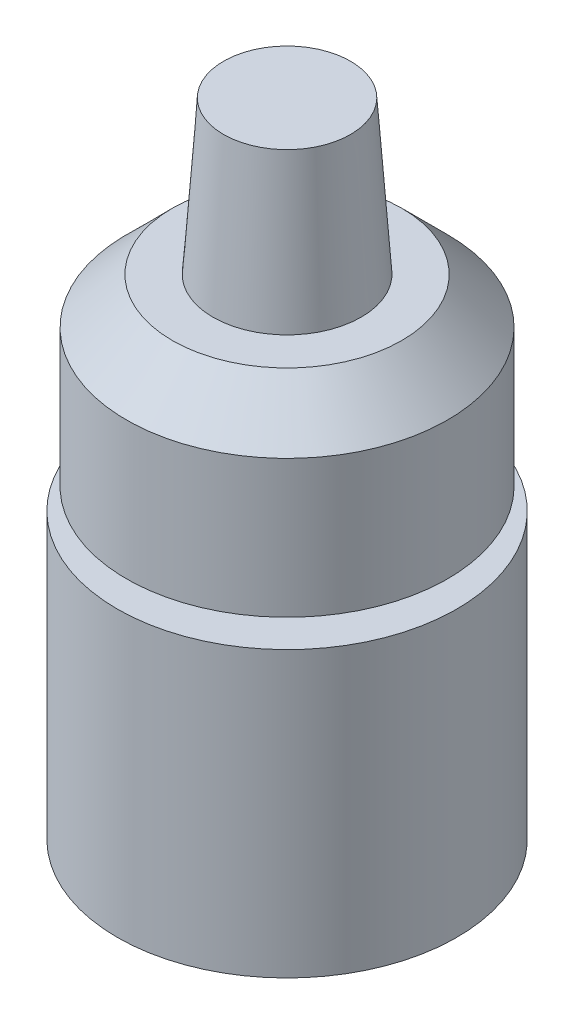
ISO-10303-21;
HEADER;
FILE_DESCRIPTION(('STEP AP214'),'2;1');
FILE_NAME('part.step','',(''),(''),'','','');
FILE_SCHEMA(('AUTOMOTIVE_DESIGN { 1 0 10303 214 1 1 1 1 }'));
ENDSEC;
DATA;
#1=APPLICATION_CONTEXT('core data for automotive mechanical design processes');
#2=APPLICATION_PROTOCOL_DEFINITION('international standard','automotive_design',2000,#1);
#3=PRODUCT_CONTEXT('',#1,'mechanical');
#4=PRODUCT('Part','Part','',(#3));
#5=PRODUCT_RELATED_PRODUCT_CATEGORY('part','',(#4));
#6=PRODUCT_DEFINITION_FORMATION('','',#4);
#7=PRODUCT_DEFINITION_CONTEXT('part definition',#1,'design');
#8=PRODUCT_DEFINITION('design','',#6,#7);
#9=PRODUCT_DEFINITION_SHAPE('','',#8);
#10=(LENGTH_UNIT() NAMED_UNIT(*) SI_UNIT(.MILLI.,.METRE.));
#11=(NAMED_UNIT(*) PLANE_ANGLE_UNIT() SI_UNIT($,.RADIAN.));
#12=(NAMED_UNIT(*) SI_UNIT($,.STERADIAN.) SOLID_ANGLE_UNIT());
#13=UNCERTAINTY_MEASURE_WITH_UNIT(LENGTH_MEASURE(1.E-05),#10,'distance_accuracy_value','');
#14=(GEOMETRIC_REPRESENTATION_CONTEXT(3) GLOBAL_UNCERTAINTY_ASSIGNED_CONTEXT((#13)) GLOBAL_UNIT_ASSIGNED_CONTEXT((#10,
#11,#12)) REPRESENTATION_CONTEXT('',''));
#15=CARTESIAN_POINT('',(0.,0.,0.));
#16=DIRECTION('',(0.,0.,1.));
#17=DIRECTION('',(1.,0.,0.));
#18=AXIS2_PLACEMENT_3D('',#15,#16,#17);
#19=CARTESIAN_POINT('',(0.,18.6,0.));
#20=DIRECTION('',(0.,-1.,0.));
#21=DIRECTION('',(0.,0.,-1.));
#22=AXIS2_PLACEMENT_3D('',#19,#20,#21);
#23=CYLINDRICAL_SURFACE('',#22,11.11);
#24=CARTESIAN_POINT('',(0.,18.6,0.));
#25=DIRECTION('',(0.,1.,0.));
#26=DIRECTION('',(0.,0.,1.));
#27=AXIS2_PLACEMENT_3D('',#24,#25,#26);
#28=CIRCLE('',#27,11.11);
#29=CARTESIAN_POINT('',(0.,18.6,11.11));
#30=VERTEX_POINT('',#29);
#31=EDGE_CURVE('E48',#30,#30,#28,.T.);
#32=ORIENTED_EDGE('',*,*,#31,.F.);
#33=EDGE_LOOP('',(#32));
#34=FACE_BOUND('',#33,.T.);
#35=CARTESIAN_POINT('',(0.,0.,0.));
#36=DIRECTION('',(0.,1.,0.));
#37=DIRECTION('',(0.,0.,1.));
#38=AXIS2_PLACEMENT_3D('',#35,#36,#37);
#39=CIRCLE('',#38,11.11);
#40=CARTESIAN_POINT('',(0.,0.,11.11));
#41=VERTEX_POINT('',#40);
#42=EDGE_CURVE('E56',#41,#41,#39,.T.);
#43=ORIENTED_EDGE('',*,*,#42,.T.);
#44=EDGE_LOOP('',(#43));
#45=FACE_BOUND('',#44,.T.);
#46=ADVANCED_FACE('F33',(#34,#45),#23,.T.);
#47=CARTESIAN_POINT('',(0.,18.6,0.));
#48=DIRECTION('',(0.,1.,0.));
#49=DIRECTION('',(0.,0.,1.));
#50=AXIS2_PLACEMENT_3D('',#47,#48,#49);
#51=PLANE('',#50);
#52=CARTESIAN_POINT('',(0.,18.6,0.));
#53=DIRECTION('',(0.,1.,0.));
#54=DIRECTION('',(0.,0.,1.));
#55=AXIS2_PLACEMENT_3D('',#52,#53,#54);
#56=CIRCLE('',#55,5.15);
#57=CARTESIAN_POINT('',(0.,18.6,5.15));
#58=VERTEX_POINT('',#57);
#59=EDGE_CURVE('E54',#58,#58,#56,.T.);
#60=ORIENTED_EDGE('',*,*,#59,.F.);
#61=EDGE_LOOP('',(#60));
#62=FACE_BOUND('',#61,.T.);
#63=ORIENTED_EDGE('',*,*,#31,.T.);
#64=EDGE_LOOP('',(#63));
#65=FACE_BOUND('',#64,.T.);
#66=ADVANCED_FACE('F83',(#62,#65),#51,.T.);
#67=CARTESIAN_POINT('',(0.,0.,0.));
#68=DIRECTION('',(0.,1.,0.));
#69=DIRECTION('',(0.,0.,1.));
#70=AXIS2_PLACEMENT_3D('',#67,#68,#69);
#71=PLANE('',#70);
#72=ORIENTED_EDGE('',*,*,#42,.F.);
#73=EDGE_LOOP('',(#72));
#74=FACE_BOUND('',#73,.T.);
#75=ADVANCED_FACE('F88',(#74),#71,.F.);
#76=CARTESIAN_POINT('',(0.,26.53,0.));
#77=DIRECTION('',(0.,-1.,0.));
#78=DIRECTION('',(0.,0.,-1.));
#79=AXIS2_PLACEMENT_3D('',#76,#77,#78);
#80=CYLINDRICAL_SURFACE('',#79,5.15);
#81=CARTESIAN_POINT('',(0.,20.,0.));
#82=DIRECTION('',(0.,-1.,0.));
#83=DIRECTION('',(0.,0.,-1.));
#84=AXIS2_PLACEMENT_3D('',#81,#82,#83);
#85=CIRCLE('',#84,5.15);
#86=CARTESIAN_POINT('',(0.,20.,-5.15));
#87=VERTEX_POINT('',#86);
#88=EDGE_CURVE('E51',#87,#87,#85,.T.);
#89=ORIENTED_EDGE('',*,*,#88,.T.);
#90=EDGE_LOOP('',(#89));
#91=FACE_BOUND('',#90,.T.);
#92=ORIENTED_EDGE('',*,*,#59,.T.);
#93=EDGE_LOOP('',(#92));
#94=FACE_BOUND('',#93,.T.);
#95=ADVANCED_FACE('F95',(#91,#94),#80,.T.);
#96=CARTESIAN_POINT('',(0.,32.,0.));
#97=DIRECTION('',(0.,-1.,0.));
#98=DIRECTION('',(0.,0.,-1.));
#99=AXIS2_PLACEMENT_3D('',#96,#97,#98);
#100=CYLINDRICAL_SURFACE('',#99,10.5);
#101=CARTESIAN_POINT('',(0.,29.,0.));
#102=DIRECTION('',(0.,-1.,0.));
#103=DIRECTION('',(0.,0.,-1.));
#104=AXIS2_PLACEMENT_3D('',#101,#102,#103);
#105=CIRCLE('',#104,10.5);
#106=CARTESIAN_POINT('',(0.,29.,-10.5));
#107=VERTEX_POINT('',#106);
#108=EDGE_CURVE('E44',#107,#107,#105,.T.);
#109=ORIENTED_EDGE('',*,*,#108,.T.);
#110=EDGE_LOOP('',(#109));
#111=FACE_BOUND('',#110,.T.);
#112=CARTESIAN_POINT('',(0.,20.,0.));
#113=DIRECTION('',(0.,-1.,0.));
#114=DIRECTION('',(0.,0.,-1.));
#115=AXIS2_PLACEMENT_3D('',#112,#113,#114);
#116=CIRCLE('',#115,10.5);
#117=CARTESIAN_POINT('',(0.,20.,-10.5));
#118=VERTEX_POINT('',#117);
#119=EDGE_CURVE('E55',#118,#118,#116,.T.);
#120=ORIENTED_EDGE('',*,*,#119,.F.);
#121=EDGE_LOOP('',(#120));
#122=FACE_BOUND('',#121,.T.);
#123=ADVANCED_FACE('F100',(#111,#122),#100,.T.);
#124=CARTESIAN_POINT('',(0.,32.,0.));
#125=DIRECTION('',(0.,-1.,0.));
#126=DIRECTION('',(0.,0.,-1.));
#127=AXIS2_PLACEMENT_3D('',#124,#125,#126);
#128=PLANE('',#127);
#129=CARTESIAN_POINT('',(0.,32.,0.));
#130=DIRECTION('',(0.,-1.,0.));
#131=DIRECTION('',(0.,0.,-1.));
#132=AXIS2_PLACEMENT_3D('',#129,#130,#131);
#133=CIRCLE('',#132,4.85158988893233);
#134=CARTESIAN_POINT('',(0.,32.,-4.85158988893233));
#135=VERTEX_POINT('',#134);
#136=EDGE_CURVE('E10',#135,#135,#133,.F.);
#137=ORIENTED_EDGE('',*,*,#136,.F.);
#138=EDGE_LOOP('',(#137));
#139=FACE_BOUND('',#138,.T.);
#140=CARTESIAN_POINT('',(0.,32.,0.));
#141=DIRECTION('',(0.,-1.,0.));
#142=DIRECTION('',(0.,0.,-1.));
#143=AXIS2_PLACEMENT_3D('',#140,#141,#142);
#144=CIRCLE('',#143,7.49999999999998);
#145=CARTESIAN_POINT('',(0.,32.,-7.49999999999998));
#146=VERTEX_POINT('',#145);
#147=EDGE_CURVE('E40',#146,#146,#144,.F.);
#148=ORIENTED_EDGE('',*,*,#147,.T.);
#149=EDGE_LOOP('',(#148));
#150=FACE_BOUND('',#149,.T.);
#151=ADVANCED_FACE('F104',(#139,#150),#128,.F.);
#152=CARTESIAN_POINT('',(0.,20.,0.));
#153=DIRECTION('',(0.,-1.,0.));
#154=DIRECTION('',(0.,0.,-1.));
#155=AXIS2_PLACEMENT_3D('',#152,#153,#154);
#156=PLANE('',#155);
#157=ORIENTED_EDGE('',*,*,#88,.F.);
#158=EDGE_LOOP('',(#157));
#159=FACE_BOUND('',#158,.T.);
#160=ORIENTED_EDGE('',*,*,#119,.T.);
#161=EDGE_LOOP('',(#160));
#162=FACE_BOUND('',#161,.T.);
#163=ADVANCED_FACE('F79',(#159,#162),#156,.T.);
#164=CARTESIAN_POINT('',(0.,29.,0.));
#165=DIRECTION('',(0.,-1.,0.));
#166=DIRECTION('',(0.,0.,-1.));
#167=AXIS2_PLACEMENT_3D('',#164,#165,#166);
#168=CONICAL_SURFACE('',#167,10.5,0.785398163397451);
#169=ORIENTED_EDGE('',*,*,#147,.F.);
#170=EDGE_LOOP('',(#169));
#171=FACE_BOUND('',#170,.T.);
#172=ORIENTED_EDGE('',*,*,#108,.F.);
#173=EDGE_LOOP('',(#172));
#174=FACE_BOUND('',#173,.T.);
#175=ADVANCED_FACE('F35',(#171,#174),#168,.T.);
#176=CARTESIAN_POINT('',(0.,32.,0.));
#177=DIRECTION('',(0.,-1.,0.));
#178=DIRECTION('',(0.,0.,1.));
#179=AXIS2_PLACEMENT_3D('',#176,#177,#178);
#180=CONICAL_SURFACE('',#179,4.85158988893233,0.0698131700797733);
#181=CARTESIAN_POINT('',(0.,42.,0.));
#182=DIRECTION('',(0.,1.,0.));
#183=DIRECTION('',(0.,0.,1.));
#184=AXIS2_PLACEMENT_3D('',#181,#182,#183);
#185=CIRCLE('',#184,4.15232176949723);
#186=CARTESIAN_POINT('',(0.,42.,4.15232176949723));
#187=VERTEX_POINT('',#186);
#188=EDGE_CURVE('E65',#187,#187,#185,.T.);
#189=ORIENTED_EDGE('',*,*,#188,.F.);
#190=EDGE_LOOP('',(#189));
#191=FACE_BOUND('',#190,.T.);
#192=ORIENTED_EDGE('',*,*,#136,.T.);
#193=EDGE_LOOP('',(#192));
#194=FACE_BOUND('',#193,.T.);
#195=ADVANCED_FACE('F71',(#191,#194),#180,.T.);
#196=CARTESIAN_POINT('',(0.,42.,0.));
#197=DIRECTION('',(0.,1.,0.));
#198=DIRECTION('',(0.,0.,1.));
#199=AXIS2_PLACEMENT_3D('',#196,#197,#198);
#200=PLANE('',#199);
#201=ORIENTED_EDGE('',*,*,#188,.T.);
#202=EDGE_LOOP('',(#201));
#203=FACE_BOUND('',#202,.T.);
#204=ADVANCED_FACE('F69',(#203),#200,.T.);
#205=CLOSED_SHELL('',(#46,#66,#75,#95,#123,#151,#163,#175,#195,#204));
#206=MANIFOLD_SOLID_BREP('B2',#205);
#207=ADVANCED_BREP_SHAPE_REPRESENTATION('',(#18,#206),#14);
#208=SHAPE_DEFINITION_REPRESENTATION(#9,#207);
ENDSEC;
END-ISO-10303-21;
